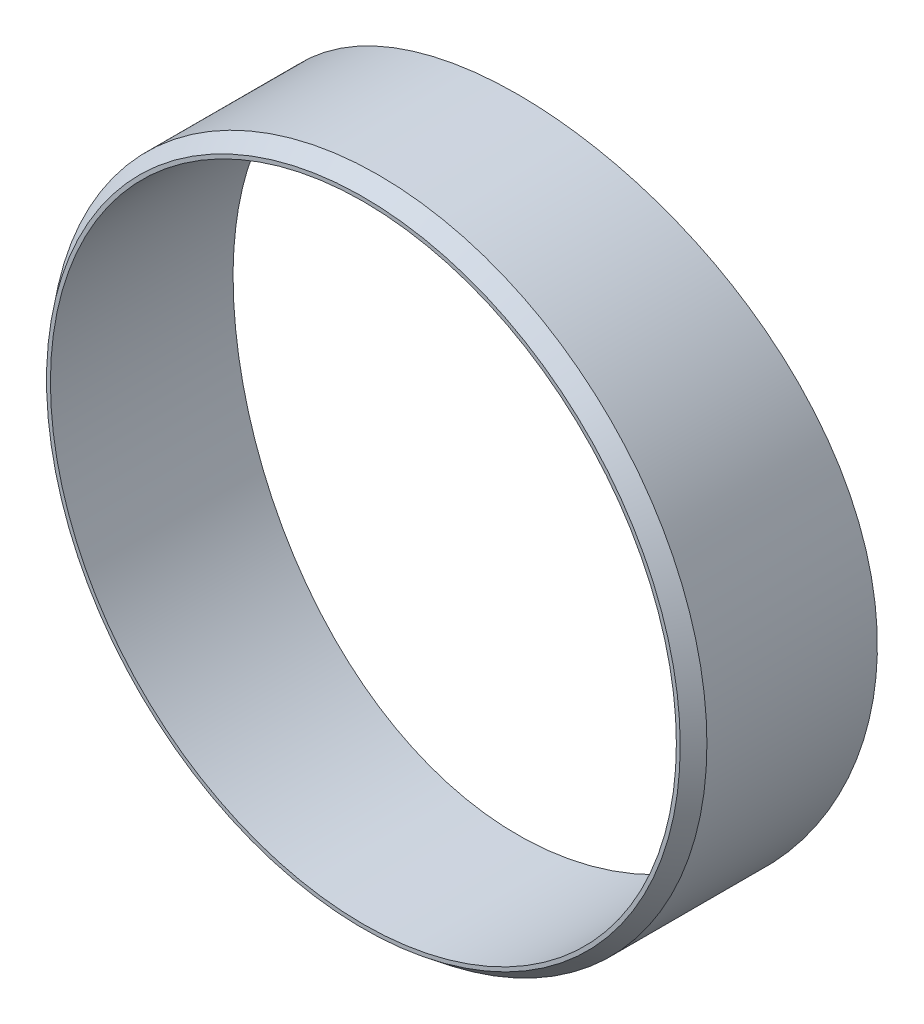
from build123d import *

# Parameters (mm, degrees)
EXTRUDE1_DEPTH          = 63.5
EXTRUDE1_DEPTH_BACK     = 177.8
SKETCH1_R               = 134.9375
SKETCH1_R_2             = 128.5875
CUT_EXTRUDE3_DEPTH      = 261.823882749
CUT_EXTRUDE3_DEPTH_BACK = 261.823882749
SKETCH3_R               = 720.725


with BuildPart() as part:
    # Sketch1 → Extrude1 (new, two sides: drawn at the far end of the back side and taken through both)
    with BuildSketch(Plane.XY.offset(-EXTRUDE1_DEPTH_BACK)):
        Circle(SKETCH1_R)
        Circle(SKETCH1_R_2, mode=Mode.SUBTRACT)
    extrude(amount=EXTRUDE1_DEPTH + EXTRUDE1_DEPTH_BACK)

    # Sketch3 → Cut-Extrude3 (cut, two sides: drawn at the far end of the back side and taken through both)
    with BuildSketch(Plane(origin=(0, 0, 0), x_dir=(1, 0, 0), z_dir=(0, 1, 0)).offset(-CUT_EXTRUDE3_DEPTH_BACK)):
        with Locations((0, 720.725)):
            Circle(SKETCH3_R)
    extrude(amount=CUT_EXTRUDE3_DEPTH + CUT_EXTRUDE3_DEPTH_BACK, mode=Mode.SUBTRACT)

    # Sketch4 → Cut-Revolve1 (revolve, cut)
    with BuildSketch(Plane(origin=(0, 0, 0), x_dir=(0, 0, -1), z_dir=(1, 0, 0))):
        Polygon((-57.293389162, 134.9375), (-63.5, 130.175), (-63.5, 134.9375), align=None)
    revolve(axis=Axis((0, 0, 104.672156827), (0, 0, -1)), mode=Mode.SUBTRACT)


solid = part.part
